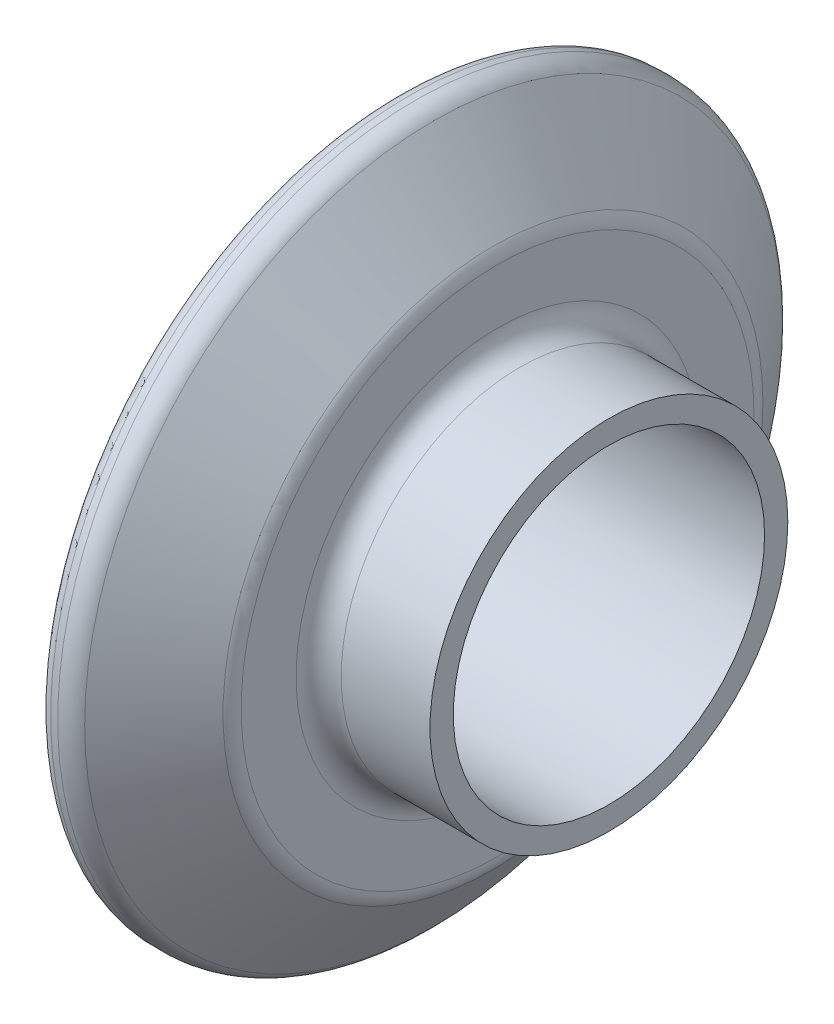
ISO-10303-21;
HEADER;
FILE_DESCRIPTION(('STEP AP214'),'2;1');
FILE_NAME('part.step','',(''),(''),'','','');
FILE_SCHEMA(('AUTOMOTIVE_DESIGN { 1 0 10303 214 1 1 1 1 }'));
ENDSEC;
DATA;
#1=APPLICATION_CONTEXT('core data for automotive mechanical design processes');
#2=APPLICATION_PROTOCOL_DEFINITION('international standard','automotive_design',2000,#1);
#3=PRODUCT_CONTEXT('',#1,'mechanical');
#4=PRODUCT('Part','Part','',(#3));
#5=PRODUCT_RELATED_PRODUCT_CATEGORY('part','',(#4));
#6=PRODUCT_DEFINITION_FORMATION('','',#4);
#7=PRODUCT_DEFINITION_CONTEXT('part definition',#1,'design');
#8=PRODUCT_DEFINITION('design','',#6,#7);
#9=PRODUCT_DEFINITION_SHAPE('','',#8);
#10=(LENGTH_UNIT() NAMED_UNIT(*) SI_UNIT(.MILLI.,.METRE.));
#11=(NAMED_UNIT(*) PLANE_ANGLE_UNIT() SI_UNIT($,.RADIAN.));
#12=(NAMED_UNIT(*) SI_UNIT($,.STERADIAN.) SOLID_ANGLE_UNIT());
#13=UNCERTAINTY_MEASURE_WITH_UNIT(LENGTH_MEASURE(1.E-05),#10,'distance_accuracy_value','');
#14=(GEOMETRIC_REPRESENTATION_CONTEXT(3) GLOBAL_UNCERTAINTY_ASSIGNED_CONTEXT((#13)) GLOBAL_UNIT_ASSIGNED_CONTEXT((#10,
#11,#12)) REPRESENTATION_CONTEXT('',''));
#15=CARTESIAN_POINT('',(0.,0.,0.));
#16=DIRECTION('',(0.,0.,1.));
#17=DIRECTION('',(1.,0.,0.));
#18=AXIS2_PLACEMENT_3D('',#15,#16,#17);
#19=CARTESIAN_POINT('',(-3.26178333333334,12.7,0.));
#20=DIRECTION('',(1.,0.,0.));
#21=DIRECTION('',(0.,0.,-1.));
#22=AXIS2_PLACEMENT_3D('',#19,#20,#21);
#23=PLANE('',#22);
#24=CARTESIAN_POINT('',(-3.26178333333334,0.,0.));
#25=DIRECTION('',(1.,0.,0.));
#26=DIRECTION('',(0.,0.,-1.));
#27=AXIS2_PLACEMENT_3D('',#24,#25,#26);
#28=CIRCLE('',#27,12.7);
#29=CARTESIAN_POINT('',(-3.26178333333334,0.,-12.7));
#30=VERTEX_POINT('',#29);
#31=EDGE_CURVE('E10',#30,#30,#28,.T.);
#32=ORIENTED_EDGE('',*,*,#31,.T.);
#33=EDGE_LOOP('',(#32));
#34=FACE_BOUND('',#33,.T.);
#35=CARTESIAN_POINT('',(-3.26178333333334,0.,0.));
#36=DIRECTION('',(1.,0.,0.));
#37=DIRECTION('',(0.,0.,-1.));
#38=AXIS2_PLACEMENT_3D('',#35,#36,#37);
#39=CIRCLE('',#38,11.049);
#40=CARTESIAN_POINT('',(-3.26178333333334,0.,-11.049));
#41=VERTEX_POINT('',#40);
#42=EDGE_CURVE('E80',#41,#41,#39,.T.);
#43=ORIENTED_EDGE('',*,*,#42,.F.);
#44=EDGE_LOOP('',(#43));
#45=FACE_BOUND('',#44,.T.);
#46=ADVANCED_FACE('F31',(#34,#45),#23,.T.);
#47=CARTESIAN_POINT('',(0.,0.,0.));
#48=DIRECTION('',(1.,0.,0.));
#49=DIRECTION('',(0.,0.,-1.));
#50=AXIS2_PLACEMENT_3D('',#47,#48,#49);
#51=CYLINDRICAL_SURFACE('',#50,12.7);
#52=CARTESIAN_POINT('',(-9.56805479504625,0.,0.));
#53=DIRECTION('',(1.,0.,0.));
#54=DIRECTION('',(0.,0.,-1.));
#55=AXIS2_PLACEMENT_3D('',#52,#53,#54);
#56=CIRCLE('',#55,12.7);
#57=CARTESIAN_POINT('',(-9.56805479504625,0.,-12.7));
#58=VERTEX_POINT('',#57);
#59=EDGE_CURVE('E37',#58,#58,#56,.T.);
#60=ORIENTED_EDGE('',*,*,#59,.T.);
#61=EDGE_LOOP('',(#60));
#62=FACE_BOUND('',#61,.T.);
#63=ORIENTED_EDGE('',*,*,#31,.F.);
#64=EDGE_LOOP('',(#63));
#65=FACE_BOUND('',#64,.T.);
#66=ADVANCED_FACE('F88',(#62,#65),#51,.T.);
#67=CARTESIAN_POINT('',(-9.56805479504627,0.,0.));
#68=DIRECTION('',(1.,0.,0.));
#69=DIRECTION('',(0.,0.,-1.));
#70=AXIS2_PLACEMENT_3D('',#67,#68,#69);
#71=TOROIDAL_SURFACE('',#70,14.3002,1.6002);
#72=CARTESIAN_POINT('',(-11.1682547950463,0.,0.));
#73=DIRECTION('',(1.,0.,0.));
#74=DIRECTION('',(0.,0.,-1.));
#75=AXIS2_PLACEMENT_3D('',#72,#73,#74);
#76=CIRCLE('',#75,14.3002);
#77=CARTESIAN_POINT('',(-11.1682547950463,0.,-14.3002));
#78=VERTEX_POINT('',#77);
#79=EDGE_CURVE('E41',#78,#78,#76,.T.);
#80=ORIENTED_EDGE('',*,*,#79,.T.);
#81=EDGE_LOOP('',(#80));
#82=FACE_BOUND('',#81,.T.);
#83=ORIENTED_EDGE('',*,*,#59,.F.);
#84=EDGE_LOOP('',(#83));
#85=FACE_BOUND('',#84,.T.);
#86=ADVANCED_FACE('F92',(#82,#85),#71,.F.);
#87=CARTESIAN_POINT('',(-11.1682547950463,14.3002,0.));
#88=DIRECTION('',(1.,0.,0.));
#89=DIRECTION('',(0.,0.,-1.));
#90=AXIS2_PLACEMENT_3D('',#87,#88,#89);
#91=PLANE('',#90);
#92=CARTESIAN_POINT('',(-11.1682547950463,0.,0.));
#93=DIRECTION('',(1.,0.,0.));
#94=DIRECTION('',(0.,0.,-1.));
#95=AXIS2_PLACEMENT_3D('',#92,#93,#94);
#96=CIRCLE('',#95,18.1999908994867);
#97=CARTESIAN_POINT('',(-11.1682547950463,0.,-18.1999908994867));
#98=VERTEX_POINT('',#97);
#99=EDGE_CURVE('E45',#98,#98,#96,.T.);
#100=ORIENTED_EDGE('',*,*,#99,.T.);
#101=EDGE_LOOP('',(#100));
#102=FACE_BOUND('',#101,.T.);
#103=ORIENTED_EDGE('',*,*,#79,.F.);
#104=EDGE_LOOP('',(#103));
#105=FACE_BOUND('',#104,.T.);
#106=ADVANCED_FACE('F96',(#102,#105),#91,.T.);
#107=CARTESIAN_POINT('',(-12.7684547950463,0.,0.));
#108=DIRECTION('',(1.,0.,0.));
#109=DIRECTION('',(0.,0.,-1.));
#110=AXIS2_PLACEMENT_3D('',#107,#108,#109);
#111=TOROIDAL_SURFACE('',#110,18.1999908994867,1.6002);
#112=CARTESIAN_POINT('',(-11.4904782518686,0.,0.));
#113=DIRECTION('',(1.,0.,0.));
#114=DIRECTION('',(0.,0.,-1.));
#115=AXIS2_PLACEMENT_3D('',#112,#113,#114);
#116=CIRCLE('',#115,19.1630152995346);
#117=CARTESIAN_POINT('',(-11.4904782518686,0.,-19.1630152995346));
#118=VERTEX_POINT('',#117);
#119=EDGE_CURVE('E50',#118,#118,#116,.T.);
#120=ORIENTED_EDGE('',*,*,#119,.T.);
#121=EDGE_LOOP('',(#120));
#122=FACE_BOUND('',#121,.T.);
#123=ORIENTED_EDGE('',*,*,#99,.F.);
#124=EDGE_LOOP('',(#123));
#125=FACE_BOUND('',#124,.T.);
#126=ADVANCED_FACE('F103',(#122,#125),#111,.T.);
#127=CARTESIAN_POINT('',(-11.4904782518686,0.,0.));
#128=DIRECTION('',(-1.,0.,0.));
#129=DIRECTION('',(0.,0.,1.));
#130=AXIS2_PLACEMENT_3D('',#127,#128,#129);
#131=CONICAL_SURFACE('',#130,19.1630152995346,0.925024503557);
#132=CARTESIAN_POINT('',(-15.7102370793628,0.,0.));
#133=DIRECTION('',(1.,0.,0.));
#134=DIRECTION('',(0.,0.,-1.));
#135=AXIS2_PLACEMENT_3D('',#132,#133,#134);
#136=CIRCLE('',#135,24.7628244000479);
#137=CARTESIAN_POINT('',(-15.7102370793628,0.,-24.7628244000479));
#138=VERTEX_POINT('',#137);
#139=EDGE_CURVE('E53',#138,#138,#136,.T.);
#140=ORIENTED_EDGE('',*,*,#139,.T.);
#141=EDGE_LOOP('',(#140));
#142=FACE_BOUND('',#141,.T.);
#143=ORIENTED_EDGE('',*,*,#119,.F.);
#144=EDGE_LOOP('',(#143));
#145=FACE_BOUND('',#144,.T.);
#146=ADVANCED_FACE('F107',(#142,#145),#131,.T.);
#147=CARTESIAN_POINT('',(-16.9882136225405,0.,0.));
#148=DIRECTION('',(1.,0.,0.));
#149=DIRECTION('',(0.,0.,-1.));
#150=AXIS2_PLACEMENT_3D('',#147,#148,#149);
#151=TOROIDAL_SURFACE('',#150,23.7998,1.60019999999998);
#152=CARTESIAN_POINT('',(-16.9882136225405,0.,0.));
#153=DIRECTION('',(1.,0.,0.));
#154=DIRECTION('',(0.,0.,-1.));
#155=AXIS2_PLACEMENT_3D('',#152,#153,#154);
#156=CIRCLE('',#155,25.4);
#157=CARTESIAN_POINT('',(-16.9882136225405,0.,-25.4));
#158=VERTEX_POINT('',#157);
#159=EDGE_CURVE('E56',#158,#158,#156,.T.);
#160=ORIENTED_EDGE('',*,*,#159,.T.);
#161=EDGE_LOOP('',(#160));
#162=FACE_BOUND('',#161,.T.);
#163=ORIENTED_EDGE('',*,*,#139,.F.);
#164=EDGE_LOOP('',(#163));
#165=FACE_BOUND('',#164,.T.);
#166=ADVANCED_FACE('F111',(#162,#165),#151,.T.);
#167=CARTESIAN_POINT('',(0.,0.,0.));
#168=DIRECTION('',(1.,0.,0.));
#169=DIRECTION('',(0.,0.,-1.));
#170=AXIS2_PLACEMENT_3D('',#167,#168,#169);
#171=CYLINDRICAL_SURFACE('',#170,25.4);
#172=CARTESIAN_POINT('',(-17.4857833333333,0.,0.));
#173=DIRECTION('',(1.,0.,0.));
#174=DIRECTION('',(0.,0.,-1.));
#175=AXIS2_PLACEMENT_3D('',#172,#173,#174);
#176=CIRCLE('',#175,25.4);
#177=CARTESIAN_POINT('',(-17.4857833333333,0.,-25.4));
#178=VERTEX_POINT('',#177);
#179=EDGE_CURVE('E59',#178,#178,#176,.T.);
#180=ORIENTED_EDGE('',*,*,#179,.T.);
#181=EDGE_LOOP('',(#180));
#182=FACE_BOUND('',#181,.T.);
#183=ORIENTED_EDGE('',*,*,#159,.F.);
#184=EDGE_LOOP('',(#183));
#185=FACE_BOUND('',#184,.T.);
#186=ADVANCED_FACE('F115',(#182,#185),#171,.T.);
#187=CARTESIAN_POINT('',(-17.4857833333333,0.,0.));
#188=DIRECTION('',(1.,0.,0.));
#189=DIRECTION('',(0.,0.,-1.));
#190=AXIS2_PLACEMENT_3D('',#187,#188,#189);
#191=TOROIDAL_SURFACE('',#190,24.5872,0.812799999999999);
#192=CARTESIAN_POINT('',(-18.2985833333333,0.,0.));
#193=DIRECTION('',(1.,0.,0.));
#194=DIRECTION('',(0.,0.,-1.));
#195=AXIS2_PLACEMENT_3D('',#192,#193,#194);
#196=CIRCLE('',#195,24.5872);
#197=CARTESIAN_POINT('',(-18.2985833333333,0.,-24.5872));
#198=VERTEX_POINT('',#197);
#199=EDGE_CURVE('E62',#198,#198,#196,.T.);
#200=ORIENTED_EDGE('',*,*,#199,.T.);
#201=EDGE_LOOP('',(#200));
#202=FACE_BOUND('',#201,.T.);
#203=ORIENTED_EDGE('',*,*,#179,.F.);
#204=EDGE_LOOP('',(#203));
#205=FACE_BOUND('',#204,.T.);
#206=ADVANCED_FACE('F119',(#202,#205),#191,.T.);
#207=CARTESIAN_POINT('',(-18.2985833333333,16.5354,0.));
#208=DIRECTION('',(-1.,0.,0.));
#209=DIRECTION('',(0.,0.,1.));
#210=AXIS2_PLACEMENT_3D('',#207,#208,#209);
#211=PLANE('',#210);
#212=CARTESIAN_POINT('',(-18.2985833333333,0.,0.));
#213=DIRECTION('',(1.,0.,0.));
#214=DIRECTION('',(0.,0.,-1.));
#215=AXIS2_PLACEMENT_3D('',#212,#213,#214);
#216=CIRCLE('',#215,16.5354);
#217=CARTESIAN_POINT('',(-18.2985833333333,0.,-16.5354));
#218=VERTEX_POINT('',#217);
#219=EDGE_CURVE('E65',#218,#218,#216,.T.);
#220=ORIENTED_EDGE('',*,*,#219,.T.);
#221=EDGE_LOOP('',(#220));
#222=FACE_BOUND('',#221,.T.);
#223=ORIENTED_EDGE('',*,*,#199,.F.);
#224=EDGE_LOOP('',(#223));
#225=FACE_BOUND('',#224,.T.);
#226=ADVANCED_FACE('F123',(#222,#225),#211,.T.);
#227=CARTESIAN_POINT('',(-19.1113833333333,0.,0.));
#228=DIRECTION('',(1.,0.,0.));
#229=DIRECTION('',(0.,0.,-1.));
#230=AXIS2_PLACEMENT_3D('',#227,#228,#229);
#231=TOROIDAL_SURFACE('',#230,16.5354,0.812799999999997);
#232=CARTESIAN_POINT('',(-19.1113833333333,0.,0.));
#233=DIRECTION('',(1.,0.,0.));
#234=DIRECTION('',(0.,0.,-1.));
#235=AXIS2_PLACEMENT_3D('',#232,#233,#234);
#236=CIRCLE('',#235,15.7226);
#237=CARTESIAN_POINT('',(-19.1113833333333,0.,-15.7226));
#238=VERTEX_POINT('',#237);
#239=EDGE_CURVE('E68',#238,#238,#236,.T.);
#240=ORIENTED_EDGE('',*,*,#239,.T.);
#241=EDGE_LOOP('',(#240));
#242=FACE_BOUND('',#241,.T.);
#243=ORIENTED_EDGE('',*,*,#219,.F.);
#244=EDGE_LOOP('',(#243));
#245=FACE_BOUND('',#244,.T.);
#246=ADVANCED_FACE('F127',(#242,#245),#231,.F.);
#247=CARTESIAN_POINT('',(0.,0.,0.));
#248=DIRECTION('',(1.,0.,0.));
#249=DIRECTION('',(0.,0.,-1.));
#250=AXIS2_PLACEMENT_3D('',#247,#248,#249);
#251=CYLINDRICAL_SURFACE('',#250,15.7226);
#252=CARTESIAN_POINT('',(-22.4387833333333,0.,0.));
#253=DIRECTION('',(1.,0.,0.));
#254=DIRECTION('',(0.,0.,-1.));
#255=AXIS2_PLACEMENT_3D('',#252,#253,#254);
#256=CIRCLE('',#255,15.7226);
#257=CARTESIAN_POINT('',(-22.4387833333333,0.,-15.7226));
#258=VERTEX_POINT('',#257);
#259=EDGE_CURVE('E71',#258,#258,#256,.T.);
#260=ORIENTED_EDGE('',*,*,#259,.T.);
#261=EDGE_LOOP('',(#260));
#262=FACE_BOUND('',#261,.T.);
#263=ORIENTED_EDGE('',*,*,#239,.F.);
#264=EDGE_LOOP('',(#263));
#265=FACE_BOUND('',#264,.T.);
#266=ADVANCED_FACE('F131',(#262,#265),#251,.T.);
#267=CARTESIAN_POINT('',(-22.4387833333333,0.,0.));
#268=DIRECTION('',(1.,0.,0.));
#269=DIRECTION('',(0.,0.,-1.));
#270=AXIS2_PLACEMENT_3D('',#267,#268,#269);
#271=TOROIDAL_SURFACE('',#270,14.9098,0.812800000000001);
#272=CARTESIAN_POINT('',(-23.2515833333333,0.,0.));
#273=DIRECTION('',(1.,0.,0.));
#274=DIRECTION('',(0.,0.,-1.));
#275=AXIS2_PLACEMENT_3D('',#272,#273,#274);
#276=CIRCLE('',#275,14.9098);
#277=CARTESIAN_POINT('',(-23.2515833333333,0.,-14.9098));
#278=VERTEX_POINT('',#277);
#279=EDGE_CURVE('E74',#278,#278,#276,.T.);
#280=ORIENTED_EDGE('',*,*,#279,.T.);
#281=EDGE_LOOP('',(#280));
#282=FACE_BOUND('',#281,.T.);
#283=ORIENTED_EDGE('',*,*,#259,.F.);
#284=EDGE_LOOP('',(#283));
#285=FACE_BOUND('',#284,.T.);
#286=ADVANCED_FACE('F135',(#282,#285),#271,.T.);
#287=CARTESIAN_POINT('',(-23.2515833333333,11.049,0.));
#288=DIRECTION('',(-1.,0.,0.));
#289=DIRECTION('',(0.,0.,1.));
#290=AXIS2_PLACEMENT_3D('',#287,#288,#289);
#291=PLANE('',#290);
#292=CARTESIAN_POINT('',(-23.2515833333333,0.,0.));
#293=DIRECTION('',(1.,0.,0.));
#294=DIRECTION('',(0.,0.,-1.));
#295=AXIS2_PLACEMENT_3D('',#292,#293,#294);
#296=CIRCLE('',#295,11.049);
#297=CARTESIAN_POINT('',(-23.2515833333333,0.,-11.049));
#298=VERTEX_POINT('',#297);
#299=EDGE_CURVE('E77',#298,#298,#296,.T.);
#300=ORIENTED_EDGE('',*,*,#299,.T.);
#301=EDGE_LOOP('',(#300));
#302=FACE_BOUND('',#301,.T.);
#303=ORIENTED_EDGE('',*,*,#279,.F.);
#304=EDGE_LOOP('',(#303));
#305=FACE_BOUND('',#304,.T.);
#306=ADVANCED_FACE('F139',(#302,#305),#291,.T.);
#307=CARTESIAN_POINT('',(0.,0.,0.));
#308=DIRECTION('',(1.,0.,0.));
#309=DIRECTION('',(0.,0.,-1.));
#310=AXIS2_PLACEMENT_3D('',#307,#308,#309);
#311=CYLINDRICAL_SURFACE('',#310,11.049);
#312=ORIENTED_EDGE('',*,*,#42,.T.);
#313=EDGE_LOOP('',(#312));
#314=FACE_BOUND('',#313,.T.);
#315=ORIENTED_EDGE('',*,*,#299,.F.);
#316=EDGE_LOOP('',(#315));
#317=FACE_BOUND('',#316,.T.);
#318=ADVANCED_FACE('F84',(#314,#317),#311,.F.);
#319=CLOSED_SHELL('',(#46,#66,#86,#106,#126,#146,#166,#186,#206,#226,#246,#266,#286,#306,#318));
#320=MANIFOLD_SOLID_BREP('B2',#319);
#321=ADVANCED_BREP_SHAPE_REPRESENTATION('',(#18,#320),#14);
#322=SHAPE_DEFINITION_REPRESENTATION(#9,#321);
ENDSEC;
END-ISO-10303-21;
